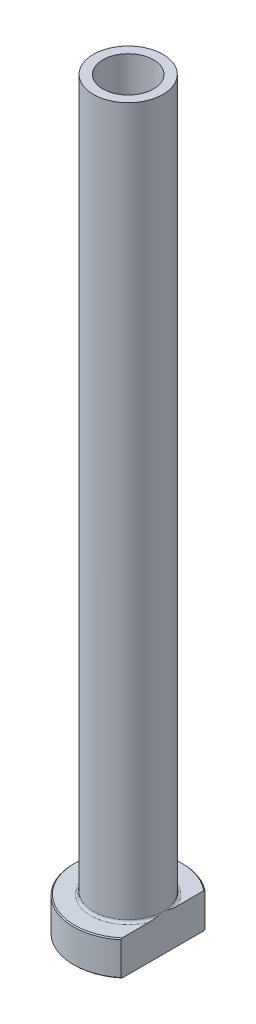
from build123d import *

# Parameters (mm, degrees)
FILLET1_R          = 0.5
CHAMFER1_SIZE      = 0.2
CUT_EXTRUDE1_DEPTH = 151.804509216
CHAMFER2_SIZE      = 0.5


with BuildPart() as part:
    # Sketch1 → Revolve1 (revolve)
    with BuildSketch(Plane.XY, mode=Mode.PRIVATE) as revolve1_sk:
        Polygon((-5.1, 150), (-7, 150), (-7, 7), (-11, 7), (-11, 0), (-5.35, 0), (-5.35, 83), (-5.1, 95), align=None)
    revolve(revolve1_sk.sketch.rotate(Axis((0, 92.187680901, 0), (0, -1, 0)), 270), axis=Axis((0, 92.187680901, 0), (0, -1, 0)))

    # Fillet1
    fillet1_edges = [part.edges().sort_by_distance(p)[0] for p in [
        (0, 7, -7),
    ]]
    fillet(fillet1_edges, radius=FILLET1_R)

    # Chamfer1
    chamfer1_edges = [part.edges().sort_by_distance(p)[0] for p in [
        (0, 0, -11),
        (0, 7, -11),
    ]]
    chamfer(chamfer1_edges, length=CHAMFER1_SIZE)

    # Sketch2 → Cut-Extrude1 (cut, through all)
    with BuildSketch(Plane.XZ):
        with BuildLine():
            Line((7, 8.485281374), (7, -8.485281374))
            ThreePointArc((7, -8.485281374), (11, 0), (7, 8.485281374))
        make_face()
    extrude(amount=-CUT_EXTRUDE1_DEPTH, mode=Mode.SUBTRACT)

    # Chamfer2
    chamfer2_edges = [part.edges().sort_by_distance(p)[0] for p in [
        (0, 0, -5.35),
    ]]
    chamfer(chamfer2_edges, length=CHAMFER2_SIZE)


solid = part.part
